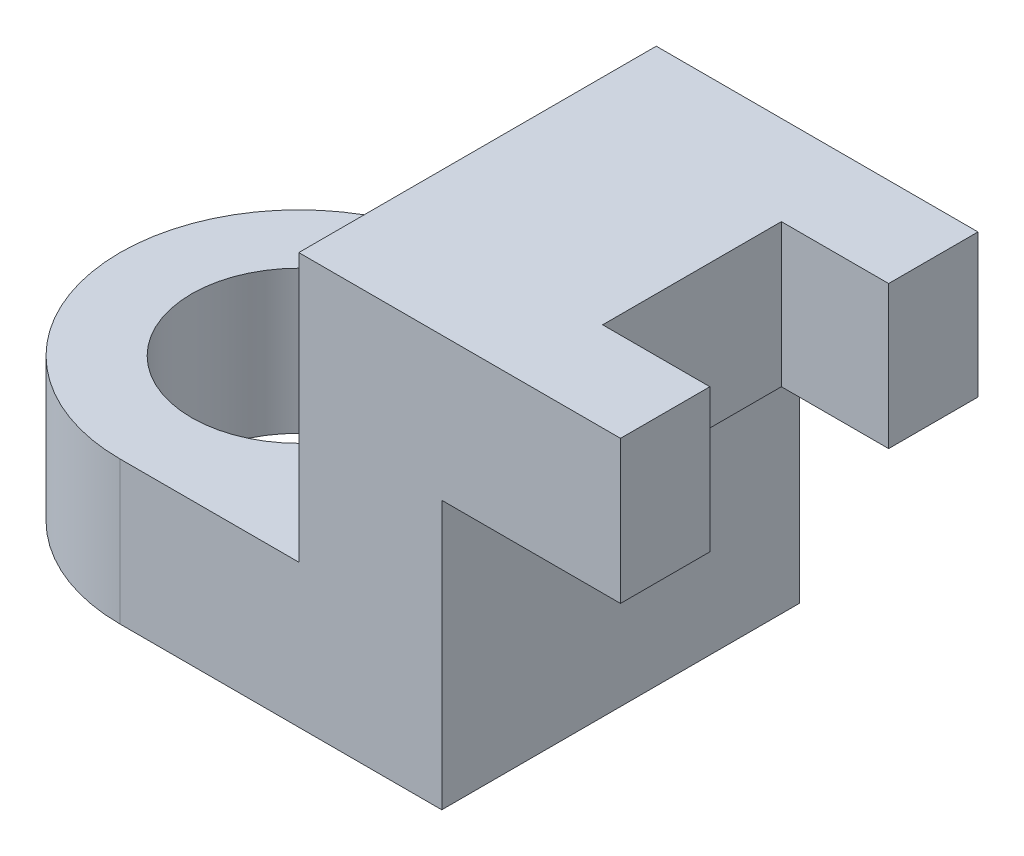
from build123d import *

# Parameters (mm, degrees)
SKETCH_1_W          = 28
SKETCH_1_H          = 20
EXTRUDE_1_DEPTH     = 8
SKETCH_2_W          = 8
SKETCH_2_H          = 20
EXTRUDE_2_DEPTH     = 15
SKETCH_4_R          = 6
CUT_EXTRUDE_2_DEPTH = 38.536648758
FILLET_1_RADIUS     = 10
FILLET_1_LENGTH     = 8
SKETCH_5_W          = 20
SKETCH_5_H          = 8
EXTRUDE_3_DEPTH     = 10
SKETCH_6_W          = 6
SKETCH_6_H          = 10
CUT_EXTRUDE_3_DEPTH = 49.713447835


with BuildPart() as part:
    # Sketch 1 → Extrude 1 (new body)
    with BuildSketch(Plane(origin=(0, 0, 0), x_dir=(1, 0, 0), z_dir=(0, 1, 0))):
        with Locations((14, 10)):
            Rectangle(SKETCH_1_W, SKETCH_1_H)
    extrude(amount=EXTRUDE_1_DEPTH)

    # Sketch 2 → Extrude 2 (add)
    with BuildSketch(Plane(origin=(0, 8, 0), x_dir=(1, 0, 0), z_dir=(0, 1, 0))):
        with Locations((24, 10)):
            Rectangle(SKETCH_2_W, SKETCH_2_H)
    extrude(amount=EXTRUDE_2_DEPTH)

    # Sketch 4 → Cut-Extrude 2 (cut, through all)
    with BuildSketch(Plane(origin=(0, 8, 0), x_dir=(1, 0, 0), z_dir=(0, 1, 0))):
        with Locations(Location((10, 10, 0), (0, 0, 270))):
            Circle(SKETCH_4_R)
    extrude(amount=-CUT_EXTRUDE_2_DEPTH, mode=Mode.SUBTRACT)

    # Fillet 1: full round fillet: the end face becomes a half cylinder, R = half its width
    fillet_1_face = Plane((0, 4, -10), x_dir=(0, -1, 0), z_dir=(-1, 0, 0))  # on the end face: x along it, z out of the body
    fillet_1_slab = fillet_1_face.offset(-FILLET_1_RADIUS / 2) * Box(FILLET_1_LENGTH, 2 * FILLET_1_RADIUS, FILLET_1_RADIUS, mode=Mode.PRIVATE)  # the body's end, R deep
    fillet_1_round = Plane((10, 4, -10), x_dir=(-1, 0, 0), z_dir=(0, -1, 0)) * Cylinder(FILLET_1_RADIUS, FILLET_1_LENGTH, mode=Mode.PRIVATE)  # its axis R under the face
    add(fillet_1_slab - fillet_1_round, mode=Mode.SUBTRACT)

    # Sketch 5 → Extrude 3 (add)
    with BuildSketch(Plane(origin=(28, 0, 0), x_dir=(0, 0, -1), z_dir=(1, 0, 0))):
        with Locations((10, 19)):
            Rectangle(SKETCH_5_W, SKETCH_5_H)
    extrude(amount=EXTRUDE_3_DEPTH)

    # Sketch 6 → Cut-Extrude 3 (cut, through all)
    with BuildSketch(Plane(origin=(0, 23, 0), x_dir=(1, 0, 0), z_dir=(0, 1, 0))):
        with Locations((35, 10)):
            Rectangle(SKETCH_6_W, SKETCH_6_H)
    extrude(amount=-CUT_EXTRUDE_3_DEPTH, mode=Mode.SUBTRACT)


solid = part.part
